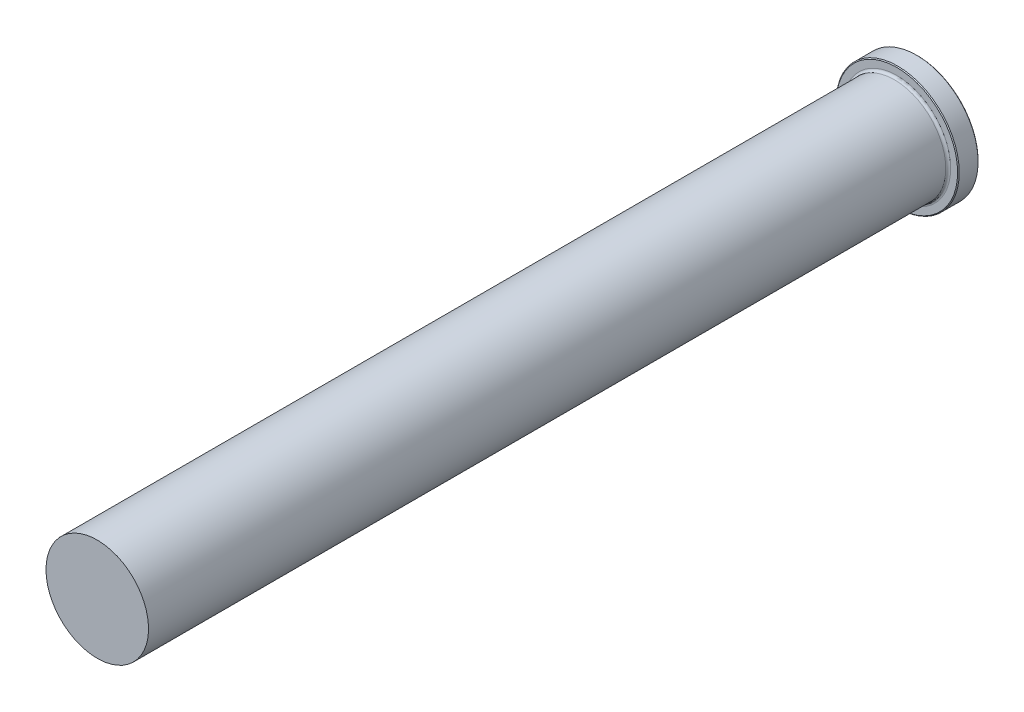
from build123d import *

# Parameters (mm, degrees)
FILLET1_R     = 0.762
CHAMFER1_SIZE = 0.254


with BuildPart() as part:
    # Sketch1 → Revolve1 (revolve)
    with BuildSketch(Plane(origin=(0, 0, 0), x_dir=(0, 0, -1), z_dir=(1, 0, 0)), mode=Mode.PRIVATE) as revolve1_sk:
        Polygon((0, 0), (0, 19.05), (-6.35, 19.05), (-6.35, 15.875), (-254, 15.875), (-254, 0), align=None)
    revolve(revolve1_sk.sketch.rotate(Axis((0, 0, 0), (0, 0, 1)), 90), axis=Axis((0, 0, 0), (0, 0, 1)))

    # Fillet1
    fillet1_edges = [part.edges().sort_by_distance(p)[0] for p in [
        (15.875, 0, 6.35),
    ]]
    fillet(fillet1_edges, radius=FILLET1_R)

    # Chamfer1
    chamfer1_edges = [part.edges().sort_by_distance(p)[0] for p in [
        (19.05, 0, 6.35),
        (19.05, 0, 0),
    ]]
    chamfer(chamfer1_edges, length=CHAMFER1_SIZE)


solid = part.part
